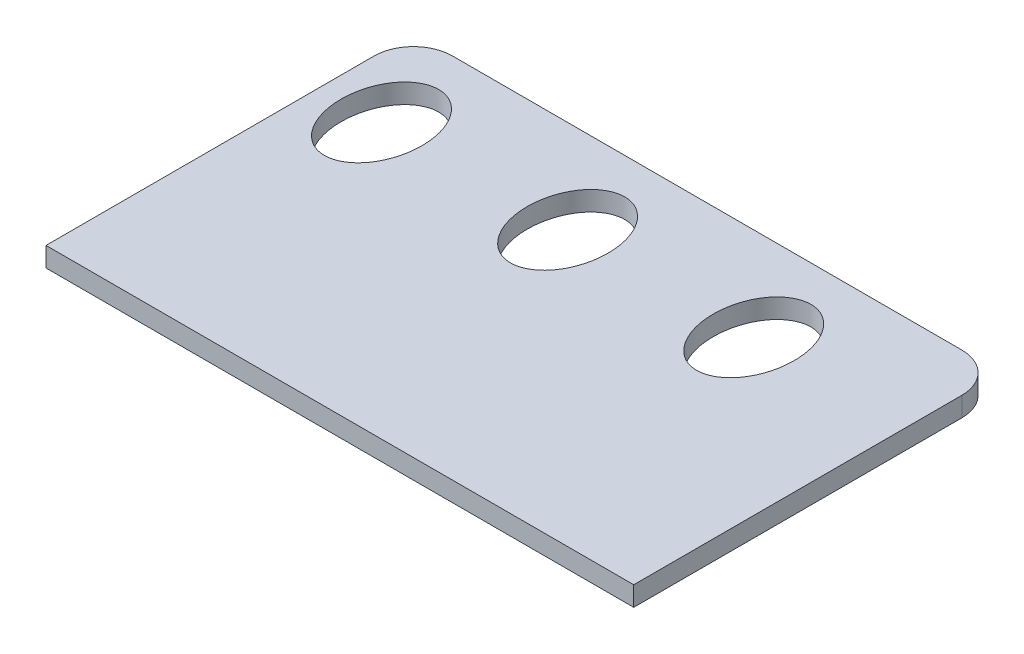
ISO-10303-21;
HEADER;
FILE_DESCRIPTION(('STEP AP214'),'2;1');
FILE_NAME('part.step','',(''),(''),'','','');
FILE_SCHEMA(('AUTOMOTIVE_DESIGN { 1 0 10303 214 1 1 1 1 }'));
ENDSEC;
DATA;
#1=APPLICATION_CONTEXT('core data for automotive mechanical design processes');
#2=APPLICATION_PROTOCOL_DEFINITION('international standard','automotive_design',2000,#1);
#3=PRODUCT_CONTEXT('',#1,'mechanical');
#4=PRODUCT('Part','Part','',(#3));
#5=PRODUCT_RELATED_PRODUCT_CATEGORY('part','',(#4));
#6=PRODUCT_DEFINITION_FORMATION('','',#4);
#7=PRODUCT_DEFINITION_CONTEXT('part definition',#1,'design');
#8=PRODUCT_DEFINITION('design','',#6,#7);
#9=PRODUCT_DEFINITION_SHAPE('','',#8);
#10=(LENGTH_UNIT() NAMED_UNIT(*) SI_UNIT(.MILLI.,.METRE.));
#11=(NAMED_UNIT(*) PLANE_ANGLE_UNIT() SI_UNIT($,.RADIAN.));
#12=(NAMED_UNIT(*) SI_UNIT($,.STERADIAN.) SOLID_ANGLE_UNIT());
#13=UNCERTAINTY_MEASURE_WITH_UNIT(LENGTH_MEASURE(1.E-05),#10,'distance_accuracy_value','');
#14=(GEOMETRIC_REPRESENTATION_CONTEXT(3) GLOBAL_UNCERTAINTY_ASSIGNED_CONTEXT((#13)) GLOBAL_UNIT_ASSIGNED_CONTEXT((#10,
#11,#12)) REPRESENTATION_CONTEXT('',''));
#15=CARTESIAN_POINT('',(0.,0.,0.));
#16=DIRECTION('',(0.,0.,1.));
#17=DIRECTION('',(1.,0.,0.));
#18=AXIS2_PLACEMENT_3D('',#15,#16,#17);
#19=CARTESIAN_POINT('',(-52.,4.,-29.5));
#20=DIRECTION('',(0.,1.,0.));
#21=DIRECTION('',(0.,0.,1.));
#22=AXIS2_PLACEMENT_3D('',#19,#20,#21);
#23=PLANE('',#22);
#24=CARTESIAN_POINT('',(-9.50000000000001,4.,-18.5));
#25=DIRECTION('',(0.,1.,0.));
#26=DIRECTION('',(0.,0.,1.));
#27=AXIS2_PLACEMENT_3D('',#24,#25,#26);
#28=ELLIPSE('',#27,11.6672618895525,8.25);
#29=CARTESIAN_POINT('',(-9.5,4.,-6.83273811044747));
#30=VERTEX_POINT('',#29);
#31=EDGE_CURVE('E176',#30,#30,#28,.T.);
#32=ORIENTED_EDGE('',*,*,#31,.F.);
#33=EDGE_LOOP('',(#32));
#34=FACE_BOUND('',#33,.T.);
#35=DIRECTION('',(0.,0.,-1.));
#36=VECTOR('',#35,1.);
#37=CARTESIAN_POINT('',(60.,4.,-29.4999999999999));
#38=LINE('',#37,#36);
#39=CARTESIAN_POINT('',(60.,4.,37.5));
#40=VERTEX_POINT('',#39);
#41=CARTESIAN_POINT('',(60.,4.,-29.4999999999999));
#42=VERTEX_POINT('',#41);
#43=EDGE_CURVE('E129',#40,#42,#38,.T.);
#44=ORIENTED_EDGE('',*,*,#43,.T.);
#45=CARTESIAN_POINT('',(52.,4.,-29.5));
#46=DIRECTION('',(0.,1.,0.));
#47=DIRECTION('',(0.,0.,-1.));
#48=AXIS2_PLACEMENT_3D('',#45,#46,#47);
#49=CIRCLE('',#48,8.);
#50=CARTESIAN_POINT('',(51.9999999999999,4.,-37.5));
#51=VERTEX_POINT('',#50);
#52=EDGE_CURVE('E87',#42,#51,#49,.T.);
#53=ORIENTED_EDGE('',*,*,#52,.T.);
#54=DIRECTION('',(-1.,0.,0.));
#55=VECTOR('',#54,1.);
#56=CARTESIAN_POINT('',(-52.,4.,-37.5));
#57=LINE('',#56,#55);
#58=CARTESIAN_POINT('',(-52.,4.,-37.5));
#59=VERTEX_POINT('',#58);
#60=EDGE_CURVE('E100',#51,#59,#57,.T.);
#61=ORIENTED_EDGE('',*,*,#60,.T.);
#62=CARTESIAN_POINT('',(-52.,4.,-29.5));
#63=DIRECTION('',(0.,1.,0.));
#64=DIRECTION('',(0.,0.,1.));
#65=AXIS2_PLACEMENT_3D('',#62,#63,#64);
#66=CIRCLE('',#65,8.);
#67=CARTESIAN_POINT('',(-60.,4.,-29.4999999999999));
#68=VERTEX_POINT('',#67);
#69=EDGE_CURVE('E94',#59,#68,#66,.T.);
#70=ORIENTED_EDGE('',*,*,#69,.T.);
#71=DIRECTION('',(0.,0.,1.));
#72=VECTOR('',#71,1.);
#73=CARTESIAN_POINT('',(-60.,4.,-29.4999999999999));
#74=LINE('',#73,#72);
#75=CARTESIAN_POINT('',(-60.,4.,37.5));
#76=VERTEX_POINT('',#75);
#77=EDGE_CURVE('E98',#68,#76,#74,.T.);
#78=ORIENTED_EDGE('',*,*,#77,.T.);
#79=DIRECTION('',(1.,0.,0.));
#80=VECTOR('',#79,1.);
#81=CARTESIAN_POINT('',(-60.,4.,37.5));
#82=LINE('',#81,#80);
#83=EDGE_CURVE('E50',#76,#40,#82,.T.);
#84=ORIENTED_EDGE('',*,*,#83,.T.);
#85=EDGE_LOOP('',(#44,#53,#61,#70,#78,#84));
#86=FACE_BOUND('',#85,.T.);
#87=CARTESIAN_POINT('',(-47.5,4.,-18.5));
#88=DIRECTION('',(0.,1.,0.));
#89=DIRECTION('',(0.,0.,1.));
#90=AXIS2_PLACEMENT_3D('',#87,#88,#89);
#91=ELLIPSE('',#90,11.6672618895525,8.25);
#92=CARTESIAN_POINT('',(-47.5,4.,-6.83273811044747));
#93=VERTEX_POINT('',#92);
#94=EDGE_CURVE('E122',#93,#93,#91,.T.);
#95=ORIENTED_EDGE('',*,*,#94,.F.);
#96=EDGE_LOOP('',(#95));
#97=FACE_BOUND('',#96,.T.);
#98=CARTESIAN_POINT('',(28.5,4.,-18.5));
#99=DIRECTION('',(0.,1.,0.));
#100=DIRECTION('',(0.,0.,1.));
#101=AXIS2_PLACEMENT_3D('',#98,#99,#100);
#102=ELLIPSE('',#101,11.6672618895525,8.25);
#103=CARTESIAN_POINT('',(28.5,4.,-6.83273811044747));
#104=VERTEX_POINT('',#103);
#105=EDGE_CURVE('E182',#104,#104,#102,.T.);
#106=ORIENTED_EDGE('',*,*,#105,.F.);
#107=EDGE_LOOP('',(#106));
#108=FACE_BOUND('',#107,.T.);
#109=ADVANCED_FACE('F33',(#34,#86,#97,#108),#23,.T.);
#110=CARTESIAN_POINT('',(-52.,0.,-29.5));
#111=DIRECTION('',(0.,1.,0.));
#112=DIRECTION('',(0.,0.,1.));
#113=AXIS2_PLACEMENT_3D('',#110,#111,#112);
#114=PLANE('',#113);
#115=CARTESIAN_POINT('',(-9.50000000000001,0.,-18.5));
#116=DIRECTION('',(0.,1.,0.));
#117=DIRECTION('',(0.,0.,1.));
#118=AXIS2_PLACEMENT_3D('',#115,#116,#117);
#119=ELLIPSE('',#118,11.6672618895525,8.25);
#120=CARTESIAN_POINT('',(-9.5,0.,-6.83273811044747));
#121=VERTEX_POINT('',#120);
#122=EDGE_CURVE('E173',#121,#121,#119,.T.);
#123=ORIENTED_EDGE('',*,*,#122,.T.);
#124=EDGE_LOOP('',(#123));
#125=FACE_BOUND('',#124,.T.);
#126=DIRECTION('',(0.,0.,-1.));
#127=VECTOR('',#126,1.);
#128=CARTESIAN_POINT('',(60.,0.,-29.4999999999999));
#129=LINE('',#128,#127);
#130=CARTESIAN_POINT('',(60.,0.,37.5));
#131=VERTEX_POINT('',#130);
#132=CARTESIAN_POINT('',(60.,0.,-29.4999999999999));
#133=VERTEX_POINT('',#132);
#134=EDGE_CURVE('E118',#131,#133,#129,.T.);
#135=ORIENTED_EDGE('',*,*,#134,.F.);
#136=DIRECTION('',(1.,0.,0.));
#137=VECTOR('',#136,1.);
#138=CARTESIAN_POINT('',(-60.,0.,37.5));
#139=LINE('',#138,#137);
#140=CARTESIAN_POINT('',(-60.,0.,37.5));
#141=VERTEX_POINT('',#140);
#142=EDGE_CURVE('E79',#141,#131,#139,.T.);
#143=ORIENTED_EDGE('',*,*,#142,.F.);
#144=DIRECTION('',(0.,0.,1.));
#145=VECTOR('',#144,1.);
#146=CARTESIAN_POINT('',(-60.,0.,-29.4999999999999));
#147=LINE('',#146,#145);
#148=CARTESIAN_POINT('',(-60.,0.,-29.4999999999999));
#149=VERTEX_POINT('',#148);
#150=EDGE_CURVE('E73',#149,#141,#147,.T.);
#151=ORIENTED_EDGE('',*,*,#150,.F.);
#152=CARTESIAN_POINT('',(-52.,0.,-29.5));
#153=DIRECTION('',(0.,1.,0.));
#154=DIRECTION('',(0.,0.,1.));
#155=AXIS2_PLACEMENT_3D('',#152,#153,#154);
#156=CIRCLE('',#155,8.);
#157=CARTESIAN_POINT('',(-52.,0.,-37.5));
#158=VERTEX_POINT('',#157);
#159=EDGE_CURVE('E108',#158,#149,#156,.T.);
#160=ORIENTED_EDGE('',*,*,#159,.F.);
#161=DIRECTION('',(-1.,0.,0.));
#162=VECTOR('',#161,1.);
#163=CARTESIAN_POINT('',(-52.,0.,-37.5));
#164=LINE('',#163,#162);
#165=CARTESIAN_POINT('',(51.9999999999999,0.,-37.5));
#166=VERTEX_POINT('',#165);
#167=EDGE_CURVE('E124',#166,#158,#164,.T.);
#168=ORIENTED_EDGE('',*,*,#167,.F.);
#169=CARTESIAN_POINT('',(52.,0.,-29.5));
#170=DIRECTION('',(0.,1.,0.));
#171=DIRECTION('',(0.,0.,-1.));
#172=AXIS2_PLACEMENT_3D('',#169,#170,#171);
#173=CIRCLE('',#172,8.);
#174=EDGE_CURVE('E121',#133,#166,#173,.T.);
#175=ORIENTED_EDGE('',*,*,#174,.F.);
#176=EDGE_LOOP('',(#135,#143,#151,#160,#168,#175));
#177=FACE_BOUND('',#176,.T.);
#178=CARTESIAN_POINT('',(-47.5,0.,-18.5));
#179=DIRECTION('',(0.,1.,0.));
#180=DIRECTION('',(0.,0.,1.));
#181=AXIS2_PLACEMENT_3D('',#178,#179,#180);
#182=ELLIPSE('',#181,11.6672618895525,8.25);
#183=CARTESIAN_POINT('',(-47.5,0.,-6.83273811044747));
#184=VERTEX_POINT('',#183);
#185=EDGE_CURVE('E172',#184,#184,#182,.T.);
#186=ORIENTED_EDGE('',*,*,#185,.T.);
#187=EDGE_LOOP('',(#186));
#188=FACE_BOUND('',#187,.T.);
#189=CARTESIAN_POINT('',(28.5,0.,-18.5));
#190=DIRECTION('',(0.,1.,0.));
#191=DIRECTION('',(0.,0.,1.));
#192=AXIS2_PLACEMENT_3D('',#189,#190,#191);
#193=ELLIPSE('',#192,11.6672618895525,8.25);
#194=CARTESIAN_POINT('',(28.5,0.,-6.83273811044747));
#195=VERTEX_POINT('',#194);
#196=EDGE_CURVE('E185',#195,#195,#193,.T.);
#197=ORIENTED_EDGE('',*,*,#196,.T.);
#198=EDGE_LOOP('',(#197));
#199=FACE_BOUND('',#198,.T.);
#200=ADVANCED_FACE('F138',(#125,#177,#188,#199),#114,.F.);
#201=CARTESIAN_POINT('',(60.,4.,-29.4999999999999));
#202=DIRECTION('',(-1.,0.,0.));
#203=DIRECTION('',(0.,0.,1.));
#204=AXIS2_PLACEMENT_3D('',#201,#202,#203);
#205=PLANE('',#204);
#206=ORIENTED_EDGE('',*,*,#134,.T.);
#207=DIRECTION('',(0.,-1.,0.));
#208=VECTOR('',#207,1.);
#209=CARTESIAN_POINT('',(60.,4.,-29.4999999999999));
#210=LINE('',#209,#208);
#211=EDGE_CURVE('E11',#42,#133,#210,.T.);
#212=ORIENTED_EDGE('',*,*,#211,.F.);
#213=ORIENTED_EDGE('',*,*,#43,.F.);
#214=DIRECTION('',(0.,-1.,0.));
#215=VECTOR('',#214,1.);
#216=CARTESIAN_POINT('',(60.,4.,37.5));
#217=LINE('',#216,#215);
#218=EDGE_CURVE('E114',#40,#131,#217,.T.);
#219=ORIENTED_EDGE('',*,*,#218,.T.);
#220=EDGE_LOOP('',(#206,#212,#213,#219));
#221=FACE_BOUND('',#220,.T.);
#222=ADVANCED_FACE('F35',(#221),#205,.F.);
#223=CARTESIAN_POINT('',(52.,4.,-29.5));
#224=DIRECTION('',(0.,-1.,0.));
#225=DIRECTION('',(0.,0.,-1.));
#226=AXIS2_PLACEMENT_3D('',#223,#224,#225);
#227=CYLINDRICAL_SURFACE('',#226,8.);
#228=ORIENTED_EDGE('',*,*,#174,.T.);
#229=DIRECTION('',(0.,-1.,0.));
#230=VECTOR('',#229,1.);
#231=CARTESIAN_POINT('',(51.9999999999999,4.,-37.5));
#232=LINE('',#231,#230);
#233=EDGE_CURVE('E42',#51,#166,#232,.T.);
#234=ORIENTED_EDGE('',*,*,#233,.F.);
#235=ORIENTED_EDGE('',*,*,#52,.F.);
#236=ORIENTED_EDGE('',*,*,#211,.T.);
#237=EDGE_LOOP('',(#228,#234,#235,#236));
#238=FACE_BOUND('',#237,.T.);
#239=ADVANCED_FACE('F236',(#238),#227,.T.);
#240=CARTESIAN_POINT('',(-52.,4.,-37.5));
#241=DIRECTION('',(0.,0.,1.));
#242=DIRECTION('',(1.,0.,0.));
#243=AXIS2_PLACEMENT_3D('',#240,#241,#242);
#244=PLANE('',#243);
#245=ORIENTED_EDGE('',*,*,#167,.T.);
#246=DIRECTION('',(0.,-1.,0.));
#247=VECTOR('',#246,1.);
#248=CARTESIAN_POINT('',(-52.,4.,-37.5));
#249=LINE('',#248,#247);
#250=EDGE_CURVE('E109',#59,#158,#249,.T.);
#251=ORIENTED_EDGE('',*,*,#250,.F.);
#252=ORIENTED_EDGE('',*,*,#60,.F.);
#253=ORIENTED_EDGE('',*,*,#233,.T.);
#254=EDGE_LOOP('',(#245,#251,#252,#253));
#255=FACE_BOUND('',#254,.T.);
#256=ADVANCED_FACE('F135',(#255),#244,.F.);
#257=CARTESIAN_POINT('',(-52.,4.,-29.5));
#258=DIRECTION('',(0.,-1.,0.));
#259=DIRECTION('',(0.,0.,-1.));
#260=AXIS2_PLACEMENT_3D('',#257,#258,#259);
#261=CYLINDRICAL_SURFACE('',#260,8.);
#262=ORIENTED_EDGE('',*,*,#159,.T.);
#263=DIRECTION('',(0.,-1.,0.));
#264=VECTOR('',#263,1.);
#265=CARTESIAN_POINT('',(-60.,4.,-29.4999999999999));
#266=LINE('',#265,#264);
#267=EDGE_CURVE('E105',#68,#149,#266,.T.);
#268=ORIENTED_EDGE('',*,*,#267,.F.);
#269=ORIENTED_EDGE('',*,*,#69,.F.);
#270=ORIENTED_EDGE('',*,*,#250,.T.);
#271=EDGE_LOOP('',(#262,#268,#269,#270));
#272=FACE_BOUND('',#271,.T.);
#273=ADVANCED_FACE('F106',(#272),#261,.T.);
#274=CARTESIAN_POINT('',(-60.,4.,-29.4999999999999));
#275=DIRECTION('',(1.,0.,0.));
#276=DIRECTION('',(0.,0.,-1.));
#277=AXIS2_PLACEMENT_3D('',#274,#275,#276);
#278=PLANE('',#277);
#279=ORIENTED_EDGE('',*,*,#150,.T.);
#280=DIRECTION('',(0.,-1.,0.));
#281=VECTOR('',#280,1.);
#282=CARTESIAN_POINT('',(-60.,4.,37.5));
#283=LINE('',#282,#281);
#284=EDGE_CURVE('E110',#76,#141,#283,.T.);
#285=ORIENTED_EDGE('',*,*,#284,.F.);
#286=ORIENTED_EDGE('',*,*,#77,.F.);
#287=ORIENTED_EDGE('',*,*,#267,.T.);
#288=EDGE_LOOP('',(#279,#285,#286,#287));
#289=FACE_BOUND('',#288,.T.);
#290=ADVANCED_FACE('F112',(#289),#278,.F.);
#291=CARTESIAN_POINT('',(-60.,4.,37.5));
#292=DIRECTION('',(0.,0.,-1.));
#293=DIRECTION('',(-1.,0.,0.));
#294=AXIS2_PLACEMENT_3D('',#291,#292,#293);
#295=PLANE('',#294);
#296=ORIENTED_EDGE('',*,*,#142,.T.);
#297=ORIENTED_EDGE('',*,*,#218,.F.);
#298=ORIENTED_EDGE('',*,*,#83,.F.);
#299=ORIENTED_EDGE('',*,*,#284,.T.);
#300=EDGE_LOOP('',(#296,#297,#298,#299));
#301=FACE_BOUND('',#300,.T.);
#302=ADVANCED_FACE('F143',(#301),#295,.F.);
#303=DIRECTION('',(0.,-1.,0.));
#304=VECTOR('',#303,1.);
#305=SURFACE_OF_LINEAR_EXTRUSION('',#91,#304);
#306=ORIENTED_EDGE('',*,*,#94,.T.);
#307=EDGE_LOOP('',(#306));
#308=FACE_BOUND('',#307,.T.);
#309=ORIENTED_EDGE('',*,*,#185,.F.);
#310=EDGE_LOOP('',(#309));
#311=FACE_BOUND('',#310,.T.);
#312=ADVANCED_FACE('F145',(#308,#311),#305,.T.);
#313=DIRECTION('',(0.,-1.,0.));
#314=VECTOR('',#313,1.);
#315=SURFACE_OF_LINEAR_EXTRUSION('',#28,#314);
#316=ORIENTED_EDGE('',*,*,#31,.T.);
#317=EDGE_LOOP('',(#316));
#318=FACE_BOUND('',#317,.T.);
#319=ORIENTED_EDGE('',*,*,#122,.F.);
#320=EDGE_LOOP('',(#319));
#321=FACE_BOUND('',#320,.T.);
#322=ADVANCED_FACE('F151',(#318,#321),#315,.T.);
#323=DIRECTION('',(0.,-1.,0.));
#324=VECTOR('',#323,1.);
#325=SURFACE_OF_LINEAR_EXTRUSION('',#102,#324);
#326=ORIENTED_EDGE('',*,*,#105,.T.);
#327=EDGE_LOOP('',(#326));
#328=FACE_BOUND('',#327,.T.);
#329=ORIENTED_EDGE('',*,*,#196,.F.);
#330=EDGE_LOOP('',(#329));
#331=FACE_BOUND('',#330,.T.);
#332=ADVANCED_FACE('F190',(#328,#331),#325,.T.);
#333=CLOSED_SHELL('',(#109,#200,#222,#239,#256,#273,#290,#302,#312,#322,#332));
#334=MANIFOLD_SOLID_BREP('B2',#333);
#335=ADVANCED_BREP_SHAPE_REPRESENTATION('',(#18,#334),#14);
#336=SHAPE_DEFINITION_REPRESENTATION(#9,#335);
ENDSEC;
END-ISO-10303-21;
